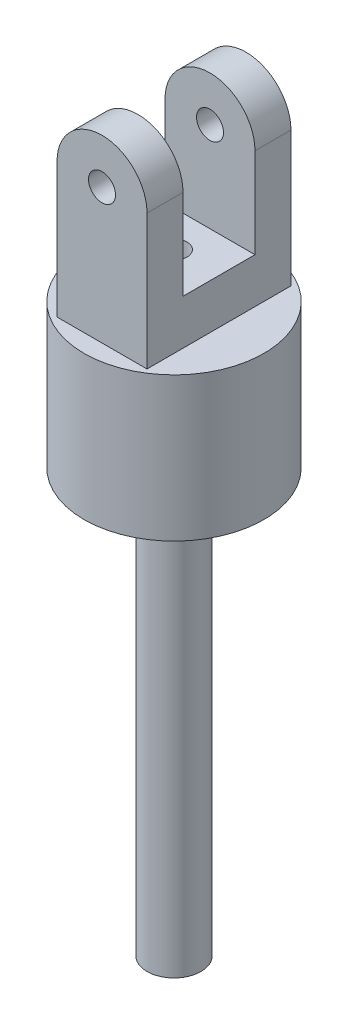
from build123d import *

# Parameters (mm, degrees)
SKETCH_1_W          = 10
SKETCH_1_H          = 4
EXTRUDE_1_DEPTH     = 15
EXTRUDE_1_2_DEPTH   = 15
SKETCH_1_4_W        = 10
SKETCH_1_4_H        = 8
SKETCH_1_4_H_2      = 4
EXTRUDE_2_DEPTH     = 4
CUT_EXTRUDE_3_REACH = 28.944
SKETCH_2_R          = 1.5
SKETCH_3_R          = 3
EXTRUDE_3_DEPTH     = 64
SKETCH_4_W          = 10
SKETCH_4_H          = 16
EXTRUDE_4_DEPTH     = 1
SKETCH_5_R          = 3
EXTRUDE_5_DEPTH     = 4
SKETCH_5_3_R        = 10
EXTRUDE_6_DEPTH     = 16
SKETCH_6_R          = 1.45
CUT_EXTRUDE_6_DEPTH = 87.332609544


with BuildPart() as part:
    # Sketch 1 → Extrude 1 (new body)
    with BuildSketch(Plane(origin=(0, 0, 0), x_dir=(1, 0, 0), z_dir=(0, 1, 0))):
        with Locations((-10.652173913, 4.260869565)):
            Rectangle(SKETCH_1_W, SKETCH_1_H)
    extrude(amount=EXTRUDE_1_DEPTH)



with BuildPart() as body_2:
    # Sketch 1 → Extrude 1 2 (new body)
    with BuildSketch(Plane(origin=(0, 0, 0), x_dir=(1, 0, 0), z_dir=(0, 1, 0))):
        with Locations((-10.652173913, -7.739130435)):
            Rectangle(SKETCH_1_W, SKETCH_1_H)
    extrude(amount=EXTRUDE_1_2_DEPTH)


with BuildPart() as part_1:
    add(part.part)

    add(body_2.part)  # Extrude 2 merges body 2
    # Sketch 1_4 → Extrude 2 (add)
    with BuildSketch(Plane(origin=(0, 0, 0), x_dir=(1, 0, 0), z_dir=(0, 1, 0))):
        with Locations((-10.652173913, -1.739130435)):
            Rectangle(SKETCH_1_4_W, SKETCH_1_4_H)
        with Locations((-10.652173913, -7.739130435)):
            Rectangle(SKETCH_1_4_W, SKETCH_1_4_H_2)
        with Locations((-10.652173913, 4.260869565)):
            Rectangle(SKETCH_1_4_W, SKETCH_1_4_H_2)
    extrude(amount=-EXTRUDE_2_DEPTH)

    # Cut-Extrude 3: up to this face of the body (flat: up to its plane)
    cut_extrude_3_end = Plane(part_1.part.faces().sort_by_distance((-10.652173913, 5.5, -6.260869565))[0])
    # Sketch 2 → Cut-Extrude 3 (cut, up to the picked face)
    with BuildSketch(Plane.XY.offset(9.739130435), mode=Mode.PRIVATE) as cut_extrude_3_sk1:
        with Locations((-10.652173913, 10)):
            Circle(SKETCH_2_R)
    cut_extrude_3_tool1 = split(extrude(cut_extrude_3_sk1.sketch, amount=-CUT_EXTRUDE_3_REACH, mode=Mode.PRIVATE), bisect_by=cut_extrude_3_end, keep=Keep.BOTH, mode=Mode.PRIVATE)
    # Sketch 2 → Cut-Extrude 3 (cut, up to the picked face)
    with BuildSketch(Plane.XY.offset(9.739130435), mode=Mode.PRIVATE) as cut_extrude_3_sk2:
        with BuildLine():
            Line((-15.652173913, 15), (-15.652173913, 10))
            ThreePointArc((-15.652173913, 10), (-14.187707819, 13.535533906), (-10.652173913, 15))
            Line((-10.652173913, 15), (-15.652173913, 15))
        make_face()
    cut_extrude_3_tool2 = split(extrude(cut_extrude_3_sk2.sketch, amount=-CUT_EXTRUDE_3_REACH, mode=Mode.PRIVATE), bisect_by=cut_extrude_3_end, keep=Keep.BOTH, mode=Mode.PRIVATE)
    # Sketch 2 → Cut-Extrude 3 (cut, up to the picked face)
    with BuildSketch(Plane.XY.offset(9.739130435), mode=Mode.PRIVATE) as cut_extrude_3_sk3:
        with BuildLine():
            ThreePointArc((-10.652173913, 15), (-7.116640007, 13.535533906), (-5.652173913, 10))
            Line((-5.652173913, 10), (-5.652173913, 15))
            Line((-5.652173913, 15), (-10.652173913, 15))
        make_face()
    cut_extrude_3_tool3 = split(extrude(cut_extrude_3_sk3.sketch, amount=-CUT_EXTRUDE_3_REACH, mode=Mode.PRIVATE), bisect_by=cut_extrude_3_end, keep=Keep.BOTH, mode=Mode.PRIVATE)
    add(cut_extrude_3_tool1.solids().sort_by(Axis((-10.652174, 10, 9.73913), (0, 0, -1)))[0], mode=Mode.SUBTRACT)
    add(cut_extrude_3_tool2.solids().sort_by(Axis((-14.535334, 13.88316, 9.73913), (0, 0, -1)))[0], mode=Mode.SUBTRACT)
    add(cut_extrude_3_tool3.solids().sort_by(Axis((-6.769014, 13.88316, 9.73913), (0, 0, -1)))[0], mode=Mode.SUBTRACT)

    # Sketch 3 → Extrude 3 (add)
    with BuildSketch(Plane.XZ.offset(4)):
        with Locations(Location((-10.652173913, 1.739130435, 0), (0, 0, 270))):
            Circle(SKETCH_3_R)
    extrude(amount=EXTRUDE_3_DEPTH)

    # Sketch 4 → Extrude 4 (add)
    with BuildSketch(Plane.XZ.offset(4)):
        with Locations((-10.652173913, 1.739130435)):
            Rectangle(SKETCH_4_W, SKETCH_4_H)
    extrude(amount=EXTRUDE_4_DEPTH)

    # Sketch 5 → Extrude 5 (add)
    # profile 1 of 3: a face of its own
    with BuildSketch(Plane.XZ.offset(5)):
        with BuildLine():
            Line((-15.652173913, -4.505867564), (-15.652173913, 7.984128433))
            ThreePointArc((-15.652173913, 7.984128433), (-18.652173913, 1.739130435), (-15.652173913, -4.505867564))
        make_face()
    # profile 2 of 3: a face of its own
    with BuildSketch(Plane.XZ.offset(5)):
        with BuildLine():
            ThreePointArc((-5.652173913, 7.984128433), (-8.002644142, 9.287639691), (-10.652173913, 9.739130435))
            ThreePointArc((-10.652173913, 9.739130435), (-13.301703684, 9.287639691), (-15.652173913, 7.984128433))
            Line((-15.652173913, 7.984128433), (-15.652173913, -4.505867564))
            ThreePointArc((-15.652173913, -4.505867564), (-13.301703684, -5.809378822), (-10.652173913, -6.260869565))
            ThreePointArc((-10.652173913, -6.260869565), (-8.002644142, -5.809378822), (-5.652173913, -4.505867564))
            Line((-5.652173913, -4.505867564), (-5.652173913, 7.984128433))
        make_face()
        with Locations(Location((-10.652173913, 1.739130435, 0), (0, 0, 270))):
            Circle(SKETCH_5_R, mode=Mode.SUBTRACT)
    # profile 3 of 3: a face of its own
    with BuildSketch(Plane.XZ.offset(5)):
        with BuildLine():
            ThreePointArc((-2.652173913, 1.739130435), (-3.441071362, 5.20323205), (-5.652173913, 7.984128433))
            Line((-5.652173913, 7.984128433), (-5.652173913, -4.505867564))
            ThreePointArc((-5.652173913, -4.505867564), (-3.441071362, -1.72497118), (-2.652173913, 1.739130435))
        make_face()
    extrude(amount=EXTRUDE_5_DEPTH)

    # Sketch 5_3 → Extrude 6 (add)
    # profile 1 of 5: a face of its own
    with BuildSketch(Plane.XZ.offset(5)):
        with Locations(Location((-10.652173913, 1.739130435, 0), (0, 0, 270))):
            Circle(SKETCH_5_3_R)
        with BuildLine():
            Line((-10.652173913, 9.739130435), (-5.652173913, 9.739130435))
            Line((-5.652173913, 9.739130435), (-5.652173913, 7.984128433))
            ThreePointArc((-5.652173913, 7.984128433), (-3.441071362, 5.20323205), (-2.652173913, 1.739130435))
            ThreePointArc((-2.652173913, 1.739130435), (-3.441071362, -1.72497118), (-5.652173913, -4.505867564))
            Line((-5.652173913, -4.505867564), (-5.652173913, -6.260869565))
            Line((-5.652173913, -6.260869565), (-10.652173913, -6.260869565))
            Line((-10.652173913, -6.260869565), (-15.652173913, -6.260869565))
            Line((-15.652173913, -6.260869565), (-15.652173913, -4.505867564))
            ThreePointArc((-15.652173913, -4.505867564), (-18.652173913, 1.739130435), (-15.652173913, 7.984128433))
            Line((-15.652173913, 7.984128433), (-15.652173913, 9.739130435))
            Line((-15.652173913, 9.739130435), (-10.652173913, 9.739130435))
        make_face(mode=Mode.SUBTRACT)
    # profile 2 of 5: a face of its own
    with BuildSketch(Plane.XZ.offset(5)):
        with BuildLine():
            ThreePointArc((-15.652173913, 7.984128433), (-13.301703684, 9.287639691), (-10.652173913, 9.739130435))
            Line((-10.652173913, 9.739130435), (-15.652173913, 9.739130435))
            Line((-15.652173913, 9.739130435), (-15.652173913, 7.984128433))
        make_face()
    # profile 3 of 5: a face of its own
    with BuildSketch(Plane.XZ.offset(5)):
        with BuildLine():
            Line((-5.652173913, 7.984128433), (-5.652173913, 9.739130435))
            Line((-5.652173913, 9.739130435), (-10.652173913, 9.739130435))
            ThreePointArc((-10.652173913, 9.739130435), (-8.002644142, 9.287639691), (-5.652173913, 7.984128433))
        make_face()
    # profile 4 of 5: a face of its own
    with BuildSketch(Plane.XZ.offset(5)):
        with BuildLine():
            ThreePointArc((-10.652173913, -6.260869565), (-13.301703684, -5.809378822), (-15.652173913, -4.505867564))
            Line((-15.652173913, -4.505867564), (-15.652173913, -6.260869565))
            Line((-15.652173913, -6.260869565), (-10.652173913, -6.260869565))
        make_face()
    # profile 5 of 5: a face of its own
    with BuildSketch(Plane.XZ.offset(5)):
        with BuildLine():
            Line((-5.652173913, -6.260869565), (-5.652173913, -4.505867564))
            ThreePointArc((-5.652173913, -4.505867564), (-8.002644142, -5.809378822), (-10.652173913, -6.260869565))
            Line((-10.652173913, -6.260869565), (-5.652173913, -6.260869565))
        make_face()
    extrude(amount=EXTRUDE_6_DEPTH)

    # Sketch 6 → Cut-Extrude 6 (cut, through all)
    with BuildSketch(Plane.XZ.offset(68)):
        with Locations(Location((-10.652173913, 1.739130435, 0), (0, 0, 270))):
            Circle(SKETCH_6_R)
    extrude(amount=-CUT_EXTRUDE_6_DEPTH, mode=Mode.SUBTRACT)


solid = part_1.part
